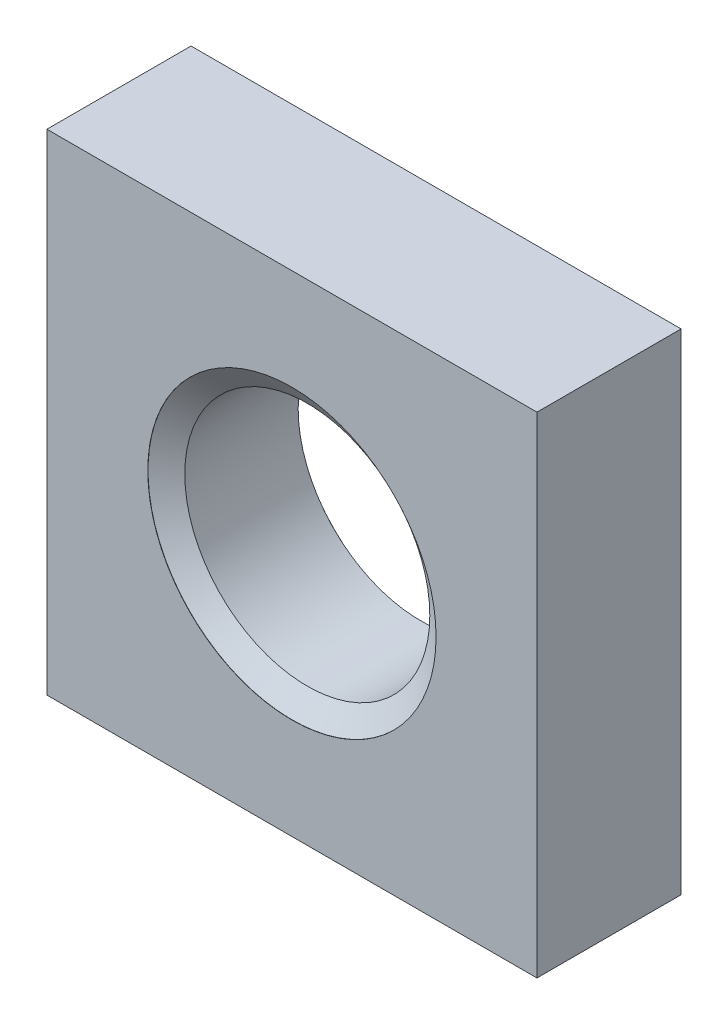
from build123d import *

# Parameters (mm, degrees)
BASENUT_START = -5
BASENUTSKE_W  = 17
BASENUTSKE_H  = 17
BASENUTSKE_R  = 4.25
BASENUT_DEPTH = 5


with BuildPart() as part:
    # BaseNutSke → BaseNut (new body)
    with BuildSketch(Plane.XY.offset(BASENUT_START)):
        Rectangle(BASENUTSKE_W, BASENUTSKE_H)
        Circle(BASENUTSKE_R, mode=Mode.SUBTRACT)
    extrude(amount=BASENUT_DEPTH)

    # EndChamferSketch → EndChamfer (revolve, cut)
    with BuildSketch(Plane(origin=(0, 0, 0), x_dir=(0, 0, -1), z_dir=(1, 0, 0)), mode=Mode.PRIVATE) as endchamfer_sk:
        Polygon((4.991, 5), (4.413328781, 4.175), (5.001, 4.175), (5.001, 5), align=None)
        Polygon((-0.002, 5), (0.008, 5), (0.585671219, 4.175), (-0.002, 4.175), align=None)
    revolve(endchamfer_sk.sketch.rotate(Axis((0, 0, -25.037505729), (0, 0, -1)), 90), axis=Axis((0, 0, -25.037505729), (0, 0, -1)), mode=Mode.SUBTRACT)


solid = part.part
